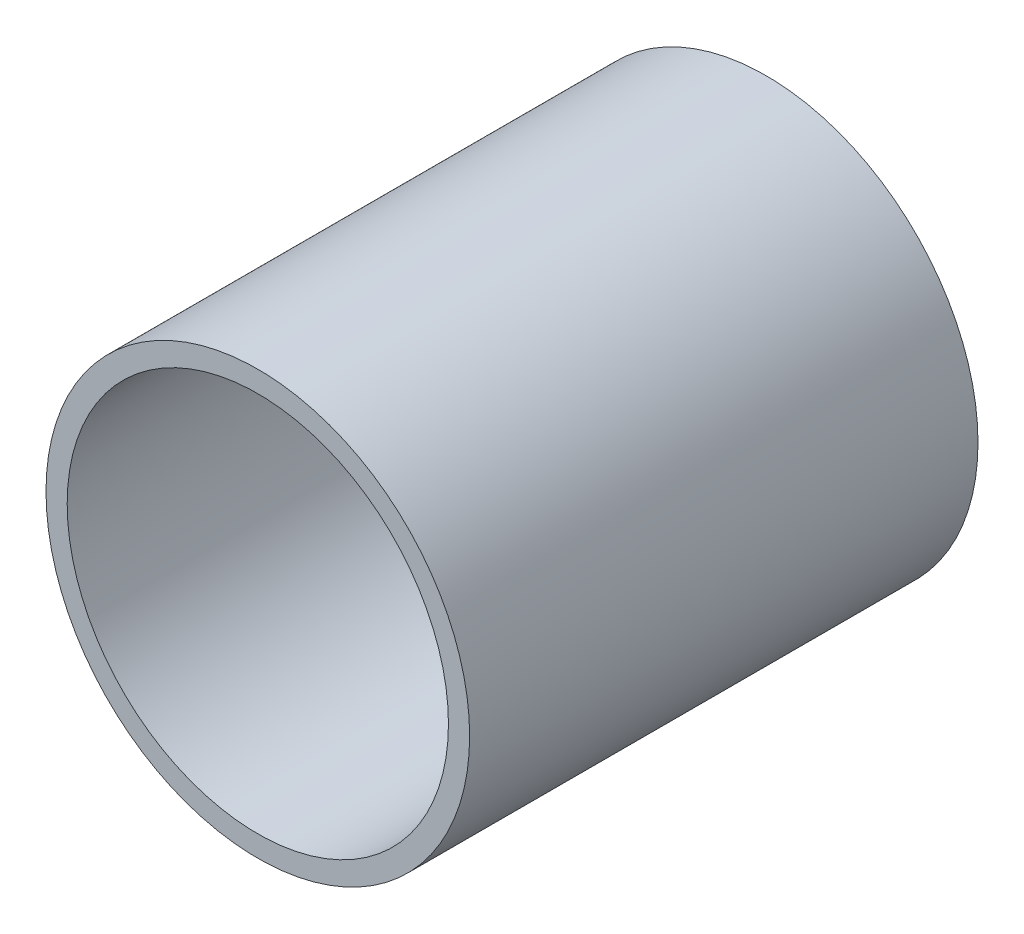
ISO-10303-21;
HEADER;
FILE_DESCRIPTION(('STEP AP214'),'2;1');
FILE_NAME('part.step','',(''),(''),'','','');
FILE_SCHEMA(('AUTOMOTIVE_DESIGN { 1 0 10303 214 1 1 1 1 }'));
ENDSEC;
DATA;
#1=APPLICATION_CONTEXT('core data for automotive mechanical design processes');
#2=APPLICATION_PROTOCOL_DEFINITION('international standard','automotive_design',2000,#1);
#3=PRODUCT_CONTEXT('',#1,'mechanical');
#4=PRODUCT('Part','Part','',(#3));
#5=PRODUCT_RELATED_PRODUCT_CATEGORY('part','',(#4));
#6=PRODUCT_DEFINITION_FORMATION('','',#4);
#7=PRODUCT_DEFINITION_CONTEXT('part definition',#1,'design');
#8=PRODUCT_DEFINITION('design','',#6,#7);
#9=PRODUCT_DEFINITION_SHAPE('','',#8);
#10=(LENGTH_UNIT() NAMED_UNIT(*) SI_UNIT(.MILLI.,.METRE.));
#11=(NAMED_UNIT(*) PLANE_ANGLE_UNIT() SI_UNIT($,.RADIAN.));
#12=(NAMED_UNIT(*) SI_UNIT($,.STERADIAN.) SOLID_ANGLE_UNIT());
#13=UNCERTAINTY_MEASURE_WITH_UNIT(LENGTH_MEASURE(1.E-05),#10,'distance_accuracy_value','');
#14=(GEOMETRIC_REPRESENTATION_CONTEXT(3) GLOBAL_UNCERTAINTY_ASSIGNED_CONTEXT((#13)) GLOBAL_UNIT_ASSIGNED_CONTEXT((#10,
#11,#12)) REPRESENTATION_CONTEXT('',''));
#15=CARTESIAN_POINT('',(0.,0.,0.));
#16=DIRECTION('',(0.,0.,1.));
#17=DIRECTION('',(1.,0.,0.));
#18=AXIS2_PLACEMENT_3D('',#15,#16,#17);
#19=CARTESIAN_POINT('',(0.,0.,120.));
#20=DIRECTION('',(0.,0.,1.));
#21=DIRECTION('',(1.,0.,0.));
#22=AXIS2_PLACEMENT_3D('',#19,#20,#21);
#23=PLANE('',#22);
#24=CARTESIAN_POINT('',(0.,0.,120.));
#25=DIRECTION('',(0.,0.,1.));
#26=DIRECTION('',(1.,0.,0.));
#27=AXIS2_PLACEMENT_3D('',#24,#25,#26);
#28=CIRCLE('',#27,50.);
#29=CARTESIAN_POINT('',(50.,0.,120.));
#30=VERTEX_POINT('',#29);
#31=EDGE_CURVE('E10',#30,#30,#28,.T.);
#32=ORIENTED_EDGE('',*,*,#31,.T.);
#33=EDGE_LOOP('',(#32));
#34=FACE_BOUND('',#33,.T.);
#35=CARTESIAN_POINT('',(0.,0.,120.));
#36=DIRECTION('',(0.,0.,1.));
#37=DIRECTION('',(1.,0.,0.));
#38=AXIS2_PLACEMENT_3D('',#35,#36,#37);
#39=CIRCLE('',#38,45.);
#40=CARTESIAN_POINT('',(45.,0.,120.));
#41=VERTEX_POINT('',#40);
#42=EDGE_CURVE('E40',#41,#41,#39,.T.);
#43=ORIENTED_EDGE('',*,*,#42,.F.);
#44=EDGE_LOOP('',(#43));
#45=FACE_BOUND('',#44,.T.);
#46=ADVANCED_FACE('F29',(#34,#45),#23,.T.);
#47=CARTESIAN_POINT('',(0.,0.,0.));
#48=DIRECTION('',(0.,0.,1.));
#49=DIRECTION('',(1.,0.,0.));
#50=AXIS2_PLACEMENT_3D('',#47,#48,#49);
#51=PLANE('',#50);
#52=CARTESIAN_POINT('',(0.,0.,0.));
#53=DIRECTION('',(0.,0.,1.));
#54=DIRECTION('',(1.,0.,0.));
#55=AXIS2_PLACEMENT_3D('',#52,#53,#54);
#56=CIRCLE('',#55,50.);
#57=CARTESIAN_POINT('',(50.,0.,0.));
#58=VERTEX_POINT('',#57);
#59=EDGE_CURVE('E36',#58,#58,#56,.T.);
#60=ORIENTED_EDGE('',*,*,#59,.F.);
#61=EDGE_LOOP('',(#60));
#62=FACE_BOUND('',#61,.T.);
#63=CARTESIAN_POINT('',(0.,0.,0.));
#64=DIRECTION('',(0.,0.,1.));
#65=DIRECTION('',(1.,0.,0.));
#66=AXIS2_PLACEMENT_3D('',#63,#64,#65);
#67=CIRCLE('',#66,45.);
#68=CARTESIAN_POINT('',(45.,0.,0.));
#69=VERTEX_POINT('',#68);
#70=EDGE_CURVE('E44',#69,#69,#67,.T.);
#71=ORIENTED_EDGE('',*,*,#70,.T.);
#72=EDGE_LOOP('',(#71));
#73=FACE_BOUND('',#72,.T.);
#74=ADVANCED_FACE('F50',(#62,#73),#51,.F.);
#75=CARTESIAN_POINT('',(0.,0.,120.));
#76=DIRECTION('',(0.,0.,-1.));
#77=DIRECTION('',(-1.,0.,0.));
#78=AXIS2_PLACEMENT_3D('',#75,#76,#77);
#79=CYLINDRICAL_SURFACE('',#78,50.);
#80=ORIENTED_EDGE('',*,*,#31,.F.);
#81=EDGE_LOOP('',(#80));
#82=FACE_BOUND('',#81,.T.);
#83=ORIENTED_EDGE('',*,*,#59,.T.);
#84=EDGE_LOOP('',(#83));
#85=FACE_BOUND('',#84,.T.);
#86=ADVANCED_FACE('F31',(#82,#85),#79,.T.);
#87=CARTESIAN_POINT('',(0.,0.,120.));
#88=DIRECTION('',(0.,0.,-1.));
#89=DIRECTION('',(-1.,0.,0.));
#90=AXIS2_PLACEMENT_3D('',#87,#88,#89);
#91=CYLINDRICAL_SURFACE('',#90,45.);
#92=ORIENTED_EDGE('',*,*,#42,.T.);
#93=EDGE_LOOP('',(#92));
#94=FACE_BOUND('',#93,.T.);
#95=ORIENTED_EDGE('',*,*,#70,.F.);
#96=EDGE_LOOP('',(#95));
#97=FACE_BOUND('',#96,.T.);
#98=ADVANCED_FACE('F52',(#94,#97),#91,.F.);
#99=CLOSED_SHELL('',(#46,#74,#86,#98));
#100=MANIFOLD_SOLID_BREP('B2',#99);
#101=ADVANCED_BREP_SHAPE_REPRESENTATION('',(#18,#100),#14);
#102=SHAPE_DEFINITION_REPRESENTATION(#9,#101);
ENDSEC;
END-ISO-10303-21;
